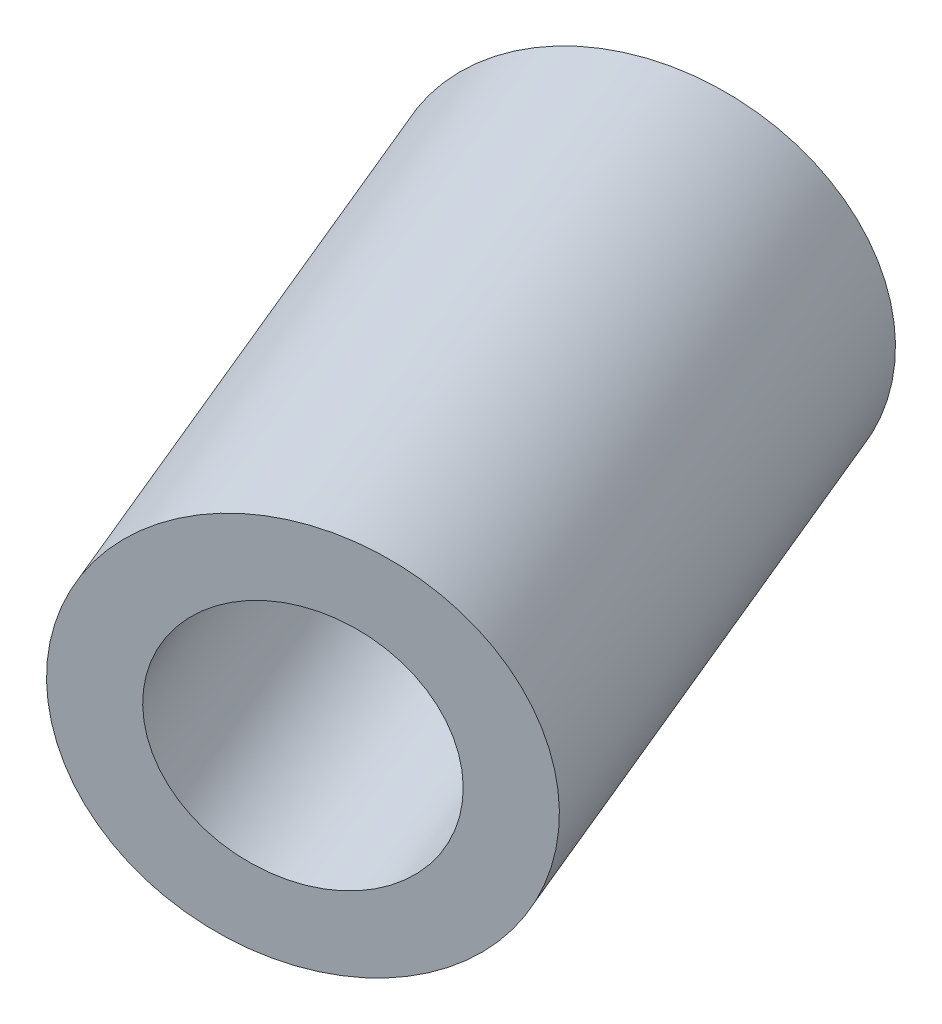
ISO-10303-21;
HEADER;
FILE_DESCRIPTION(('STEP AP214'),'2;1');
FILE_NAME('part.step','',(''),(''),'','','');
FILE_SCHEMA(('AUTOMOTIVE_DESIGN { 1 0 10303 214 1 1 1 1 }'));
ENDSEC;
DATA;
#1=APPLICATION_CONTEXT('core data for automotive mechanical design processes');
#2=APPLICATION_PROTOCOL_DEFINITION('international standard','automotive_design',2000,#1);
#3=PRODUCT_CONTEXT('',#1,'mechanical');
#4=PRODUCT('Part','Part','',(#3));
#5=PRODUCT_RELATED_PRODUCT_CATEGORY('part','',(#4));
#6=PRODUCT_DEFINITION_FORMATION('','',#4);
#7=PRODUCT_DEFINITION_CONTEXT('part definition',#1,'design');
#8=PRODUCT_DEFINITION('design','',#6,#7);
#9=PRODUCT_DEFINITION_SHAPE('','',#8);
#10=(LENGTH_UNIT() NAMED_UNIT(*) SI_UNIT(.MILLI.,.METRE.));
#11=(NAMED_UNIT(*) PLANE_ANGLE_UNIT() SI_UNIT($,.RADIAN.));
#12=(NAMED_UNIT(*) SI_UNIT($,.STERADIAN.) SOLID_ANGLE_UNIT());
#13=UNCERTAINTY_MEASURE_WITH_UNIT(LENGTH_MEASURE(1.E-05),#10,'distance_accuracy_value','');
#14=(GEOMETRIC_REPRESENTATION_CONTEXT(3) GLOBAL_UNCERTAINTY_ASSIGNED_CONTEXT((#13)) GLOBAL_UNIT_ASSIGNED_CONTEXT((#10,
#11,#12)) REPRESENTATION_CONTEXT('',''));
#15=CARTESIAN_POINT('',(0.,0.,0.));
#16=DIRECTION('',(0.,0.,1.));
#17=DIRECTION('',(1.,0.,0.));
#18=AXIS2_PLACEMENT_3D('',#15,#16,#17);
#19=CARTESIAN_POINT('',(40.1974618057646,-0.0579542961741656,-1.92656018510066));
#20=DIRECTION('',(-0.364454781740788,0.0340887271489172,-0.930596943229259));
#21=DIRECTION('',(-0.931138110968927,0.,0.364666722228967));
#22=AXIS2_PLACEMENT_3D('',#19,#20,#21);
#23=CYLINDRICAL_SURFACE('',#22,2.5);
#24=CARTESIAN_POINT('',(35.8240044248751,0.351110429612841,-13.0937235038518));
#25=DIRECTION('',(-0.364454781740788,0.0340887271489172,-0.930596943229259));
#26=DIRECTION('',(-0.931138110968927,0.,0.364666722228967));
#27=AXIS2_PLACEMENT_3D('',#24,#25,#26);
#28=CIRCLE('',#27,2.5);
#29=CARTESIAN_POINT('',(33.4961591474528,0.351110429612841,-12.1820566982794));
#30=VERTEX_POINT('',#29);
#31=EDGE_CURVE('E27',#30,#30,#28,.T.);
#32=ORIENTED_EDGE('',*,*,#31,.T.);
#33=EDGE_LOOP('',(#32));
#34=FACE_BOUND('',#33,.T.);
#35=CARTESIAN_POINT('',(40.1974618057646,-0.0579542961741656,-1.92656018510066));
#36=DIRECTION('',(-0.364454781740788,0.0340887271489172,-0.930596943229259));
#37=DIRECTION('',(-0.931138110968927,0.,0.364666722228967));
#38=AXIS2_PLACEMENT_3D('',#35,#36,#37);
#39=CIRCLE('',#38,2.5);
#40=CARTESIAN_POINT('',(37.8696165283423,-0.0579542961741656,-1.01489337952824));
#41=VERTEX_POINT('',#40);
#42=EDGE_CURVE('E18',#41,#41,#39,.T.);
#43=ORIENTED_EDGE('',*,*,#42,.F.);
#44=EDGE_LOOP('',(#43));
#45=FACE_BOUND('',#44,.T.);
#46=ADVANCED_FACE('F15',(#34,#45),#23,.F.);
#47=CARTESIAN_POINT('',(40.1974618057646,-0.0579542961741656,-1.92656018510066));
#48=DIRECTION('',(0.364454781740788,-0.0340887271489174,0.930596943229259));
#49=DIRECTION('',(0.931138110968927,0.,-0.364666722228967));
#50=AXIS2_PLACEMENT_3D('',#47,#48,#49);
#51=PLANE('',#50);
#52=ORIENTED_EDGE('',*,*,#42,.T.);
#53=EDGE_LOOP('',(#52));
#54=FACE_BOUND('',#53,.T.);
#55=CARTESIAN_POINT('',(40.1974618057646,-0.0579542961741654,-1.92656018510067));
#56=DIRECTION('',(-0.364454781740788,0.0340887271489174,-0.930596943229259));
#57=DIRECTION('',(-0.931138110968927,0.,0.364666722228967));
#58=AXIS2_PLACEMENT_3D('',#55,#56,#57);
#59=CIRCLE('',#58,4.);
#60=CARTESIAN_POINT('',(36.4729093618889,-0.0579542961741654,-0.467893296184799));
#61=VERTEX_POINT('',#60);
#62=EDGE_CURVE('E22',#61,#61,#59,.T.);
#63=ORIENTED_EDGE('',*,*,#62,.F.);
#64=EDGE_LOOP('',(#63));
#65=FACE_BOUND('',#64,.T.);
#66=ADVANCED_FACE('F35',(#54,#65),#51,.T.);
#67=CARTESIAN_POINT('',(35.8240044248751,0.351110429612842,-13.0937235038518));
#68=DIRECTION('',(0.364454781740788,-0.0340887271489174,0.930596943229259));
#69=DIRECTION('',(0.931138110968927,0.,-0.364666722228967));
#70=AXIS2_PLACEMENT_3D('',#67,#68,#69);
#71=PLANE('',#70);
#72=ORIENTED_EDGE('',*,*,#31,.F.);
#73=EDGE_LOOP('',(#72));
#74=FACE_BOUND('',#73,.T.);
#75=CARTESIAN_POINT('',(35.8240044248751,0.351110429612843,-13.0937235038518));
#76=DIRECTION('',(-0.364454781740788,0.0340887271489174,-0.930596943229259));
#77=DIRECTION('',(-0.931138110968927,0.,0.364666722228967));
#78=AXIS2_PLACEMENT_3D('',#75,#76,#77);
#79=CIRCLE('',#78,4.);
#80=CARTESIAN_POINT('',(32.0994519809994,0.351110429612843,-11.6350566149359));
#81=VERTEX_POINT('',#80);
#82=EDGE_CURVE('E10',#81,#81,#79,.F.);
#83=ORIENTED_EDGE('',*,*,#82,.F.);
#84=EDGE_LOOP('',(#83));
#85=FACE_BOUND('',#84,.T.);
#86=ADVANCED_FACE('F43',(#74,#85),#71,.F.);
#87=CARTESIAN_POINT('',(40.1974618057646,-0.0579542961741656,-1.92656018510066));
#88=DIRECTION('',(-0.364454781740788,0.0340887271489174,-0.930596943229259));
#89=DIRECTION('',(-0.931138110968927,0.,0.364666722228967));
#90=AXIS2_PLACEMENT_3D('',#87,#88,#89);
#91=CYLINDRICAL_SURFACE('',#90,4.);
#92=ORIENTED_EDGE('',*,*,#82,.T.);
#93=EDGE_LOOP('',(#92));
#94=FACE_BOUND('',#93,.T.);
#95=ORIENTED_EDGE('',*,*,#62,.T.);
#96=EDGE_LOOP('',(#95));
#97=FACE_BOUND('',#96,.T.);
#98=ADVANCED_FACE('F44',(#94,#97),#91,.T.);
#99=CLOSED_SHELL('',(#46,#66,#86,#98));
#100=MANIFOLD_SOLID_BREP('B1',#99);
#101=ADVANCED_BREP_SHAPE_REPRESENTATION('',(#18,#100),#14);
#102=SHAPE_DEFINITION_REPRESENTATION(#9,#101);
ENDSEC;
END-ISO-10303-21;
